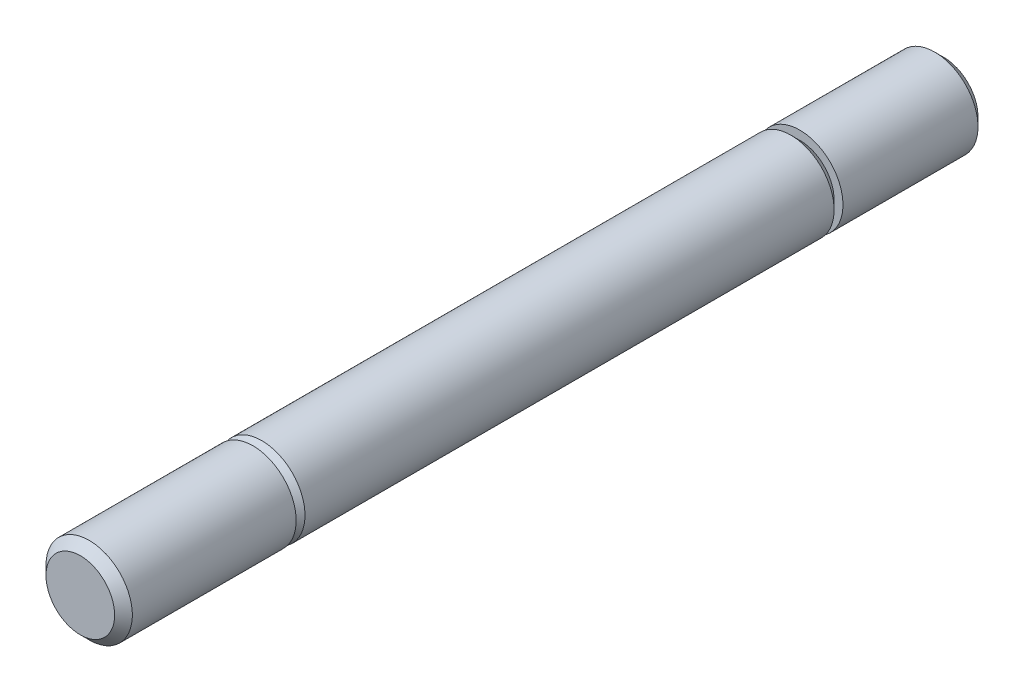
ISO-10303-21;
HEADER;
FILE_DESCRIPTION(('STEP AP214'),'2;1');
FILE_NAME('part.step','',(''),(''),'','','');
FILE_SCHEMA(('AUTOMOTIVE_DESIGN { 1 0 10303 214 1 1 1 1 }'));
ENDSEC;
DATA;
#1=APPLICATION_CONTEXT('core data for automotive mechanical design processes');
#2=APPLICATION_PROTOCOL_DEFINITION('international standard','automotive_design',2000,#1);
#3=PRODUCT_CONTEXT('',#1,'mechanical');
#4=PRODUCT('Part','Part','',(#3));
#5=PRODUCT_RELATED_PRODUCT_CATEGORY('part','',(#4));
#6=PRODUCT_DEFINITION_FORMATION('','',#4);
#7=PRODUCT_DEFINITION_CONTEXT('part definition',#1,'design');
#8=PRODUCT_DEFINITION('design','',#6,#7);
#9=PRODUCT_DEFINITION_SHAPE('','',#8);
#10=(LENGTH_UNIT() NAMED_UNIT(*) SI_UNIT(.MILLI.,.METRE.));
#11=(NAMED_UNIT(*) PLANE_ANGLE_UNIT() SI_UNIT($,.RADIAN.));
#12=(NAMED_UNIT(*) SI_UNIT($,.STERADIAN.) SOLID_ANGLE_UNIT());
#13=UNCERTAINTY_MEASURE_WITH_UNIT(LENGTH_MEASURE(1.E-05),#10,'distance_accuracy_value','');
#14=(GEOMETRIC_REPRESENTATION_CONTEXT(3) GLOBAL_UNCERTAINTY_ASSIGNED_CONTEXT((#13)) GLOBAL_UNIT_ASSIGNED_CONTEXT((#10,
#11,#12)) REPRESENTATION_CONTEXT('',''));
#15=CARTESIAN_POINT('',(0.,0.,0.));
#16=DIRECTION('',(0.,0.,1.));
#17=DIRECTION('',(1.,0.,0.));
#18=AXIS2_PLACEMENT_3D('',#15,#16,#17);
#19=CARTESIAN_POINT('',(0.,0.,0.));
#20=DIRECTION('',(0.,0.,-1.));
#21=DIRECTION('',(-1.,0.,0.));
#22=AXIS2_PLACEMENT_3D('',#19,#20,#21);
#23=PLANE('',#22);
#24=CARTESIAN_POINT('',(0.,0.,0.));
#25=DIRECTION('',(0.,0.,-1.));
#26=DIRECTION('',(-1.,0.,0.));
#27=AXIS2_PLACEMENT_3D('',#24,#25,#26);
#28=CIRCLE('',#27,2.385);
#29=CARTESIAN_POINT('',(-2.385,0.,0.));
#30=VERTEX_POINT('',#29);
#31=EDGE_CURVE('E61',#30,#30,#28,.T.);
#32=ORIENTED_EDGE('',*,*,#31,.T.);
#33=EDGE_LOOP('',(#32));
#34=FACE_BOUND('',#33,.T.);
#35=ADVANCED_FACE('F12',(#34),#23,.T.);
#36=CARTESIAN_POINT('',(0.,2.385,60.));
#37=DIRECTION('',(0.,0.,1.));
#38=DIRECTION('',(1.,0.,0.));
#39=AXIS2_PLACEMENT_3D('',#36,#37,#38);
#40=PLANE('',#39);
#41=CARTESIAN_POINT('',(0.,0.,60.));
#42=DIRECTION('',(0.,0.,-1.));
#43=DIRECTION('',(-1.,0.,0.));
#44=AXIS2_PLACEMENT_3D('',#41,#42,#43);
#45=CIRCLE('',#44,2.385);
#46=CARTESIAN_POINT('',(-2.385,0.,60.));
#47=VERTEX_POINT('',#46);
#48=EDGE_CURVE('E8',#47,#47,#45,.T.);
#49=ORIENTED_EDGE('',*,*,#48,.F.);
#50=EDGE_LOOP('',(#49));
#51=FACE_BOUND('',#50,.T.);
#52=ADVANCED_FACE('F82',(#51),#40,.T.);
#53=CARTESIAN_POINT('',(0.,0.,59.385));
#54=DIRECTION('',(0.,0.,-1.));
#55=DIRECTION('',(-1.,0.,0.));
#56=AXIS2_PLACEMENT_3D('',#53,#54,#55);
#57=CONICAL_SURFACE('',#56,3.,0.785398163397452);
#58=ORIENTED_EDGE('',*,*,#48,.T.);
#59=EDGE_LOOP('',(#58));
#60=FACE_BOUND('',#59,.T.);
#61=CARTESIAN_POINT('',(0.,0.,59.385));
#62=DIRECTION('',(0.,0.,-1.));
#63=DIRECTION('',(-1.,0.,0.));
#64=AXIS2_PLACEMENT_3D('',#61,#62,#63);
#65=CIRCLE('',#64,3.);
#66=CARTESIAN_POINT('',(-3.,0.,59.385));
#67=VERTEX_POINT('',#66);
#68=EDGE_CURVE('E19',#67,#67,#65,.T.);
#69=ORIENTED_EDGE('',*,*,#68,.F.);
#70=EDGE_LOOP('',(#69));
#71=FACE_BOUND('',#70,.T.);
#72=ADVANCED_FACE('F86',(#60,#71),#57,.T.);
#73=CARTESIAN_POINT('',(0.,0.,0.));
#74=DIRECTION('',(0.,0.,-1.));
#75=DIRECTION('',(-1.,0.,0.));
#76=AXIS2_PLACEMENT_3D('',#73,#74,#75);
#77=CYLINDRICAL_SURFACE('',#76,3.);
#78=ORIENTED_EDGE('',*,*,#68,.T.);
#79=EDGE_LOOP('',(#78));
#80=FACE_BOUND('',#79,.T.);
#81=CARTESIAN_POINT('',(0.,0.,48.));
#82=DIRECTION('',(0.,0.,-1.));
#83=DIRECTION('',(-1.,0.,0.));
#84=AXIS2_PLACEMENT_3D('',#81,#82,#83);
#85=CIRCLE('',#84,3.);
#86=CARTESIAN_POINT('',(-3.,0.,48.));
#87=VERTEX_POINT('',#86);
#88=EDGE_CURVE('E28',#87,#87,#85,.T.);
#89=ORIENTED_EDGE('',*,*,#88,.F.);
#90=EDGE_LOOP('',(#89));
#91=FACE_BOUND('',#90,.T.);
#92=ADVANCED_FACE('F91',(#80,#91),#77,.T.);
#93=CARTESIAN_POINT('',(0.,2.385,48.));
#94=DIRECTION('',(0.,0.,-1.));
#95=DIRECTION('',(-1.,0.,0.));
#96=AXIS2_PLACEMENT_3D('',#93,#94,#95);
#97=PLANE('',#96);
#98=ORIENTED_EDGE('',*,*,#88,.T.);
#99=EDGE_LOOP('',(#98));
#100=FACE_BOUND('',#99,.T.);
#101=CARTESIAN_POINT('',(0.,0.,48.));
#102=DIRECTION('',(0.,0.,-1.));
#103=DIRECTION('',(-1.,0.,0.));
#104=AXIS2_PLACEMENT_3D('',#101,#102,#103);
#105=CIRCLE('',#104,2.385);
#106=CARTESIAN_POINT('',(-2.385,0.,48.));
#107=VERTEX_POINT('',#106);
#108=EDGE_CURVE('E35',#107,#107,#105,.T.);
#109=ORIENTED_EDGE('',*,*,#108,.F.);
#110=EDGE_LOOP('',(#109));
#111=FACE_BOUND('',#110,.T.);
#112=ADVANCED_FACE('F96',(#100,#111),#97,.T.);
#113=CARTESIAN_POINT('',(0.,0.,47.385));
#114=DIRECTION('',(0.,0.,-1.));
#115=DIRECTION('',(-1.,0.,0.));
#116=AXIS2_PLACEMENT_3D('',#113,#114,#115);
#117=CONICAL_SURFACE('',#116,3.,0.785398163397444);
#118=ORIENTED_EDGE('',*,*,#108,.T.);
#119=EDGE_LOOP('',(#118));
#120=FACE_BOUND('',#119,.T.);
#121=CARTESIAN_POINT('',(0.,0.,47.385));
#122=DIRECTION('',(0.,0.,-1.));
#123=DIRECTION('',(-1.,0.,0.));
#124=AXIS2_PLACEMENT_3D('',#121,#122,#123);
#125=CIRCLE('',#124,3.);
#126=CARTESIAN_POINT('',(-3.,0.,47.385));
#127=VERTEX_POINT('',#126);
#128=EDGE_CURVE('E41',#127,#127,#125,.T.);
#129=ORIENTED_EDGE('',*,*,#128,.F.);
#130=EDGE_LOOP('',(#129));
#131=FACE_BOUND('',#130,.T.);
#132=ADVANCED_FACE('F99',(#120,#131),#117,.T.);
#133=CARTESIAN_POINT('',(0.,0.,0.));
#134=DIRECTION('',(0.,0.,-1.));
#135=DIRECTION('',(-1.,0.,0.));
#136=AXIS2_PLACEMENT_3D('',#133,#134,#135);
#137=CYLINDRICAL_SURFACE('',#136,3.);
#138=ORIENTED_EDGE('',*,*,#128,.T.);
#139=EDGE_LOOP('',(#138));
#140=FACE_BOUND('',#139,.T.);
#141=CARTESIAN_POINT('',(0.,0.,10.615));
#142=DIRECTION('',(0.,0.,-1.));
#143=DIRECTION('',(-1.,0.,0.));
#144=AXIS2_PLACEMENT_3D('',#141,#142,#143);
#145=CIRCLE('',#144,3.);
#146=CARTESIAN_POINT('',(-3.,0.,10.615));
#147=VERTEX_POINT('',#146);
#148=EDGE_CURVE('E45',#147,#147,#145,.T.);
#149=ORIENTED_EDGE('',*,*,#148,.F.);
#150=EDGE_LOOP('',(#149));
#151=FACE_BOUND('',#150,.T.);
#152=ADVANCED_FACE('F103',(#140,#151),#137,.T.);
#153=CARTESIAN_POINT('',(0.,0.,10.));
#154=DIRECTION('',(0.,0.,1.));
#155=DIRECTION('',(1.,0.,0.));
#156=AXIS2_PLACEMENT_3D('',#153,#154,#155);
#157=CONICAL_SURFACE('',#156,2.385,0.785398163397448);
#158=ORIENTED_EDGE('',*,*,#148,.T.);
#159=EDGE_LOOP('',(#158));
#160=FACE_BOUND('',#159,.T.);
#161=CARTESIAN_POINT('',(0.,0.,10.));
#162=DIRECTION('',(0.,0.,-1.));
#163=DIRECTION('',(-1.,0.,0.));
#164=AXIS2_PLACEMENT_3D('',#161,#162,#163);
#165=CIRCLE('',#164,2.385);
#166=CARTESIAN_POINT('',(-2.385,0.,10.));
#167=VERTEX_POINT('',#166);
#168=EDGE_CURVE('E49',#167,#167,#165,.T.);
#169=ORIENTED_EDGE('',*,*,#168,.F.);
#170=EDGE_LOOP('',(#169));
#171=FACE_BOUND('',#170,.T.);
#172=ADVANCED_FACE('F107',(#160,#171),#157,.T.);
#173=CARTESIAN_POINT('',(0.,3.,10.));
#174=DIRECTION('',(0.,0.,1.));
#175=DIRECTION('',(1.,0.,0.));
#176=AXIS2_PLACEMENT_3D('',#173,#174,#175);
#177=PLANE('',#176);
#178=ORIENTED_EDGE('',*,*,#168,.T.);
#179=EDGE_LOOP('',(#178));
#180=FACE_BOUND('',#179,.T.);
#181=CARTESIAN_POINT('',(0.,0.,10.));
#182=DIRECTION('',(0.,0.,-1.));
#183=DIRECTION('',(-1.,0.,0.));
#184=AXIS2_PLACEMENT_3D('',#181,#182,#183);
#185=CIRCLE('',#184,3.);
#186=CARTESIAN_POINT('',(-3.,0.,10.));
#187=VERTEX_POINT('',#186);
#188=EDGE_CURVE('E53',#187,#187,#185,.T.);
#189=ORIENTED_EDGE('',*,*,#188,.F.);
#190=EDGE_LOOP('',(#189));
#191=FACE_BOUND('',#190,.T.);
#192=ADVANCED_FACE('F78',(#180,#191),#177,.T.);
#193=CARTESIAN_POINT('',(0.,0.,0.));
#194=DIRECTION('',(0.,0.,-1.));
#195=DIRECTION('',(-1.,0.,0.));
#196=AXIS2_PLACEMENT_3D('',#193,#194,#195);
#197=CYLINDRICAL_SURFACE('',#196,3.);
#198=ORIENTED_EDGE('',*,*,#188,.T.);
#199=EDGE_LOOP('',(#198));
#200=FACE_BOUND('',#199,.T.);
#201=CARTESIAN_POINT('',(0.,0.,0.615));
#202=DIRECTION('',(0.,0.,-1.));
#203=DIRECTION('',(-1.,0.,0.));
#204=AXIS2_PLACEMENT_3D('',#201,#202,#203);
#205=CIRCLE('',#204,3.);
#206=CARTESIAN_POINT('',(-3.,0.,0.615));
#207=VERTEX_POINT('',#206);
#208=EDGE_CURVE('E57',#207,#207,#205,.T.);
#209=ORIENTED_EDGE('',*,*,#208,.F.);
#210=EDGE_LOOP('',(#209));
#211=FACE_BOUND('',#210,.T.);
#212=ADVANCED_FACE('F71',(#200,#211),#197,.T.);
#213=CARTESIAN_POINT('',(0.,0.,0.));
#214=DIRECTION('',(0.,0.,1.));
#215=DIRECTION('',(1.,0.,0.));
#216=AXIS2_PLACEMENT_3D('',#213,#214,#215);
#217=CONICAL_SURFACE('',#216,2.385,0.785398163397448);
#218=ORIENTED_EDGE('',*,*,#208,.T.);
#219=EDGE_LOOP('',(#218));
#220=FACE_BOUND('',#219,.T.);
#221=ORIENTED_EDGE('',*,*,#31,.F.);
#222=EDGE_LOOP('',(#221));
#223=FACE_BOUND('',#222,.T.);
#224=ADVANCED_FACE('F69',(#220,#223),#217,.T.);
#225=CLOSED_SHELL('',(#35,#52,#72,#92,#112,#132,#152,#172,#192,#212,#224));
#226=MANIFOLD_SOLID_BREP('B1',#225);
#227=ADVANCED_BREP_SHAPE_REPRESENTATION('',(#18,#226),#14);
#228=SHAPE_DEFINITION_REPRESENTATION(#9,#227);
ENDSEC;
END-ISO-10303-21;
